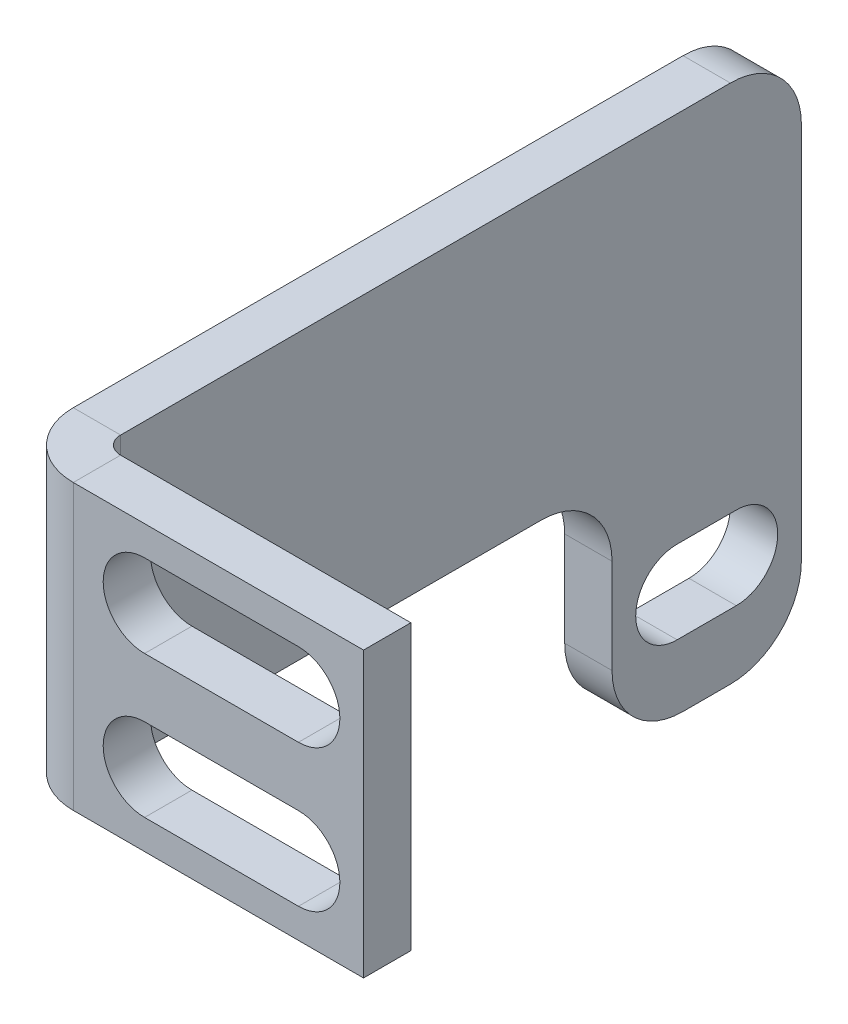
ISO-10303-21;
HEADER;
FILE_DESCRIPTION(('STEP AP214'),'2;1');
FILE_NAME('part.step','',(''),(''),'','','');
FILE_SCHEMA(('AUTOMOTIVE_DESIGN { 1 0 10303 214 1 1 1 1 }'));
ENDSEC;
DATA;
#1=APPLICATION_CONTEXT('core data for automotive mechanical design processes');
#2=APPLICATION_PROTOCOL_DEFINITION('international standard','automotive_design',2000,#1);
#3=PRODUCT_CONTEXT('',#1,'mechanical');
#4=PRODUCT('Part','Part','',(#3));
#5=PRODUCT_RELATED_PRODUCT_CATEGORY('part','',(#4));
#6=PRODUCT_DEFINITION_FORMATION('','',#4);
#7=PRODUCT_DEFINITION_CONTEXT('part definition',#1,'design');
#8=PRODUCT_DEFINITION('design','',#6,#7);
#9=PRODUCT_DEFINITION_SHAPE('','',#8);
#10=(LENGTH_UNIT() NAMED_UNIT(*) SI_UNIT(.MILLI.,.METRE.));
#11=(NAMED_UNIT(*) PLANE_ANGLE_UNIT() SI_UNIT($,.RADIAN.));
#12=(NAMED_UNIT(*) SI_UNIT($,.STERADIAN.) SOLID_ANGLE_UNIT());
#13=UNCERTAINTY_MEASURE_WITH_UNIT(LENGTH_MEASURE(1.E-05),#10,'distance_accuracy_value','');
#14=(GEOMETRIC_REPRESENTATION_CONTEXT(3) GLOBAL_UNCERTAINTY_ASSIGNED_CONTEXT((#13)) GLOBAL_UNIT_ASSIGNED_CONTEXT((#10,
#11,#12)) REPRESENTATION_CONTEXT('',''));
#15=CARTESIAN_POINT('',(0.,0.,0.));
#16=DIRECTION('',(0.,0.,1.));
#17=DIRECTION('',(1.,0.,0.));
#18=AXIS2_PLACEMENT_3D('',#15,#16,#17);
#19=CARTESIAN_POINT('',(0.,0.,0.));
#20=DIRECTION('',(0.,0.,-1.));
#21=DIRECTION('',(-1.,0.,0.));
#22=AXIS2_PLACEMENT_3D('',#19,#20,#21);
#23=PLANE('',#22);
#24=CARTESIAN_POINT('',(109.249999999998,-9.,0.));
#25=DIRECTION('',(0.,0.,-1.));
#26=DIRECTION('',(-1.,0.,0.));
#27=AXIS2_PLACEMENT_3D('',#24,#25,#26);
#28=CIRCLE('',#27,1.75);
#29=CARTESIAN_POINT('',(109.249999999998,-7.25,0.));
#30=VERTEX_POINT('',#29);
#31=CARTESIAN_POINT('',(109.249999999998,-10.75,0.));
#32=VERTEX_POINT('',#31);
#33=EDGE_CURVE('E217',#30,#32,#28,.T.);
#34=ORIENTED_EDGE('',*,*,#33,.T.);
#35=DIRECTION('',(1.,0.,0.));
#36=VECTOR('',#35,1.);
#37=CARTESIAN_POINT('',(102.749999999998,-10.75,0.));
#38=LINE('',#37,#36);
#39=CARTESIAN_POINT('',(102.749999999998,-10.75,0.));
#40=VERTEX_POINT('',#39);
#41=EDGE_CURVE('E198',#40,#32,#38,.T.);
#42=ORIENTED_EDGE('',*,*,#41,.F.);
#43=CARTESIAN_POINT('',(102.749999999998,-9.,0.));
#44=DIRECTION('',(0.,0.,-1.));
#45=DIRECTION('',(-1.,0.,0.));
#46=AXIS2_PLACEMENT_3D('',#43,#44,#45);
#47=CIRCLE('',#46,1.75);
#48=CARTESIAN_POINT('',(102.749999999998,-7.25,0.));
#49=VERTEX_POINT('',#48);
#50=EDGE_CURVE('E202',#40,#49,#47,.T.);
#51=ORIENTED_EDGE('',*,*,#50,.T.);
#52=DIRECTION('',(1.,0.,0.));
#53=VECTOR('',#52,1.);
#54=CARTESIAN_POINT('',(102.749999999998,-7.25,0.));
#55=LINE('',#54,#53);
#56=EDGE_CURVE('E800',#49,#30,#55,.T.);
#57=ORIENTED_EDGE('',*,*,#56,.T.);
#58=EDGE_LOOP('',(#34,#42,#51,#57));
#59=FACE_BOUND('',#58,.T.);
#60=DIRECTION('',(0.,1.,0.));
#61=VECTOR('',#60,1.);
#62=CARTESIAN_POINT('',(99.736599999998,0.,0.));
#63=LINE('',#62,#61);
#64=CARTESIAN_POINT('',(99.736599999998,0.,0.));
#65=VERTEX_POINT('',#64);
#66=CARTESIAN_POINT('',(99.736599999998,-12.,0.));
#67=VERTEX_POINT('',#66);
#68=EDGE_CURVE('E312',#65,#67,#63,.F.);
#69=ORIENTED_EDGE('',*,*,#68,.T.);
#70=DIRECTION('',(1.,0.,0.));
#71=VECTOR('',#70,1.);
#72=CARTESIAN_POINT('',(111.999999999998,-12.,0.));
#73=LINE('',#72,#71);
#74=CARTESIAN_POINT('',(111.999999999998,-12.,0.));
#75=VERTEX_POINT('',#74);
#76=EDGE_CURVE('E338',#67,#75,#73,.T.);
#77=ORIENTED_EDGE('',*,*,#76,.T.);
#78=DIRECTION('',(0.,1.,0.));
#79=VECTOR('',#78,1.);
#80=CARTESIAN_POINT('',(111.999999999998,0.,0.));
#81=LINE('',#80,#79);
#82=CARTESIAN_POINT('',(111.999999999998,0.,0.));
#83=VERTEX_POINT('',#82);
#84=EDGE_CURVE('E332',#75,#83,#81,.T.);
#85=ORIENTED_EDGE('',*,*,#84,.T.);
#86=DIRECTION('',(-1.,0.,0.));
#87=VECTOR('',#86,1.);
#88=CARTESIAN_POINT('',(111.999999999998,0.,0.));
#89=LINE('',#88,#87);
#90=EDGE_CURVE('E346',#83,#65,#89,.T.);
#91=ORIENTED_EDGE('',*,*,#90,.T.);
#92=EDGE_LOOP('',(#69,#77,#85,#91));
#93=FACE_BOUND('',#92,.T.);
#94=DIRECTION('',(1.,0.,0.));
#95=VECTOR('',#94,1.);
#96=CARTESIAN_POINT('',(102.749999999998,-4.75000000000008,0.));
#97=LINE('',#96,#95);
#98=CARTESIAN_POINT('',(102.749999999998,-4.75000000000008,0.));
#99=VERTEX_POINT('',#98);
#100=CARTESIAN_POINT('',(109.249999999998,-4.75000000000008,0.));
#101=VERTEX_POINT('',#100);
#102=EDGE_CURVE('E227',#99,#101,#97,.T.);
#103=ORIENTED_EDGE('',*,*,#102,.F.);
#104=CARTESIAN_POINT('',(102.749999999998,-3.00000000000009,0.));
#105=DIRECTION('',(0.,0.,-1.));
#106=DIRECTION('',(-1.,0.,0.));
#107=AXIS2_PLACEMENT_3D('',#104,#105,#106);
#108=CIRCLE('',#107,1.75);
#109=CARTESIAN_POINT('',(102.749999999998,-1.25000000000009,0.));
#110=VERTEX_POINT('',#109);
#111=EDGE_CURVE('E234',#99,#110,#108,.T.);
#112=ORIENTED_EDGE('',*,*,#111,.T.);
#113=DIRECTION('',(1.,0.,0.));
#114=VECTOR('',#113,1.);
#115=CARTESIAN_POINT('',(102.749999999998,-1.25000000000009,0.));
#116=LINE('',#115,#114);
#117=CARTESIAN_POINT('',(109.249999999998,-1.25000000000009,0.));
#118=VERTEX_POINT('',#117);
#119=EDGE_CURVE('E224',#110,#118,#116,.T.);
#120=ORIENTED_EDGE('',*,*,#119,.T.);
#121=CARTESIAN_POINT('',(109.249999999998,-3.00000000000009,0.));
#122=DIRECTION('',(0.,0.,-1.));
#123=DIRECTION('',(-1.,0.,0.));
#124=AXIS2_PLACEMENT_3D('',#121,#122,#123);
#125=CIRCLE('',#124,1.75);
#126=EDGE_CURVE('E245',#118,#101,#125,.T.);
#127=ORIENTED_EDGE('',*,*,#126,.T.);
#128=EDGE_LOOP('',(#103,#112,#120,#127));
#129=FACE_BOUND('',#128,.T.);
#130=ADVANCED_FACE('F16',(#59,#93,#129),#23,.F.);
#131=CARTESIAN_POINT('',(96.999999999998,-12.,-2.));
#132=DIRECTION('',(0.,1.,0.));
#133=DIRECTION('',(0.,0.,1.));
#134=AXIS2_PLACEMENT_3D('',#131,#132,#133);
#135=PLANE('',#134);
#136=DIRECTION('',(0.,0.,1.));
#137=VECTOR('',#136,1.);
#138=CARTESIAN_POINT('',(96.999999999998,-12.,-3.12441373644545E-13));
#139=LINE('',#138,#137);
#140=CARTESIAN_POINT('',(96.9999999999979,-12.,-20.5));
#141=VERTEX_POINT('',#140);
#142=CARTESIAN_POINT('',(96.999999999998,-12.,-2.7366));
#143=VERTEX_POINT('',#142);
#144=EDGE_CURVE('E285',#141,#143,#139,.T.);
#145=ORIENTED_EDGE('',*,*,#144,.F.);
#146=DIRECTION('',(-1.,0.,0.));
#147=VECTOR('',#146,1.);
#148=CARTESIAN_POINT('',(98.9999999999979,-12.,-20.5));
#149=LINE('',#148,#147);
#150=CARTESIAN_POINT('',(98.999999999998,-12.,-20.5));
#151=VERTEX_POINT('',#150);
#152=EDGE_CURVE('E394',#141,#151,#149,.F.);
#153=ORIENTED_EDGE('',*,*,#152,.T.);
#154=DIRECTION('',(0.,0.,-1.));
#155=VECTOR('',#154,1.);
#156=CARTESIAN_POINT('',(98.999999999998,-12.,-2.));
#157=LINE('',#156,#155);
#158=CARTESIAN_POINT('',(98.999999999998,-12.,-2.7366));
#159=VERTEX_POINT('',#158);
#160=EDGE_CURVE('E294',#151,#159,#157,.F.);
#161=ORIENTED_EDGE('',*,*,#160,.T.);
#162=DIRECTION('',(1.,0.,0.));
#163=VECTOR('',#162,1.);
#164=CARTESIAN_POINT('',(96.999999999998,-12.,-2.7366));
#165=LINE('',#164,#163);
#166=EDGE_CURVE('E284',#159,#143,#165,.F.);
#167=ORIENTED_EDGE('',*,*,#166,.T.);
#168=EDGE_LOOP('',(#145,#153,#161,#167));
#169=FACE_BOUND('',#168,.T.);
#170=ADVANCED_FACE('F404',(#169),#135,.F.);
#171=CARTESIAN_POINT('',(111.999999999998,0.,-2.));
#172=DIRECTION('',(0.,1.,0.));
#173=DIRECTION('',(-1.,0.,0.));
#174=AXIS2_PLACEMENT_3D('',#171,#172,#173);
#175=PLANE('',#174);
#176=DIRECTION('',(-1.,0.,0.));
#177=VECTOR('',#176,1.);
#178=CARTESIAN_POINT('',(111.999999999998,0.,-2.));
#179=LINE('',#178,#177);
#180=CARTESIAN_POINT('',(111.999999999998,0.,-2.));
#181=VERTEX_POINT('',#180);
#182=CARTESIAN_POINT('',(99.736599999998,0.,-2.));
#183=VERTEX_POINT('',#182);
#184=EDGE_CURVE('E337',#181,#183,#179,.T.);
#185=ORIENTED_EDGE('',*,*,#184,.T.);
#186=DIRECTION('',(0.,0.,1.));
#187=VECTOR('',#186,1.);
#188=CARTESIAN_POINT('',(99.736599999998,0.,-2.));
#189=LINE('',#188,#187);
#190=EDGE_CURVE('E318',#183,#65,#189,.T.);
#191=ORIENTED_EDGE('',*,*,#190,.T.);
#192=ORIENTED_EDGE('',*,*,#90,.F.);
#193=DIRECTION('',(0.,0.,1.));
#194=VECTOR('',#193,1.);
#195=CARTESIAN_POINT('',(111.999999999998,0.,-2.));
#196=LINE('',#195,#194);
#197=EDGE_CURVE('E343',#181,#83,#196,.T.);
#198=ORIENTED_EDGE('',*,*,#197,.F.);
#199=EDGE_LOOP('',(#185,#191,#192,#198));
#200=FACE_BOUND('',#199,.T.);
#201=ADVANCED_FACE('F481',(#200),#175,.T.);
#202=CARTESIAN_POINT('',(0.,0.,-2.));
#203=DIRECTION('',(0.,0.,-1.));
#204=DIRECTION('',(-1.,0.,0.));
#205=AXIS2_PLACEMENT_3D('',#202,#203,#204);
#206=PLANE('',#205);
#207=CARTESIAN_POINT('',(109.249999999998,-9.,-2.));
#208=DIRECTION('',(0.,0.,-1.));
#209=DIRECTION('',(-1.,0.,0.));
#210=AXIS2_PLACEMENT_3D('',#207,#208,#209);
#211=CIRCLE('',#210,1.75);
#212=CARTESIAN_POINT('',(109.249999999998,-7.25,-2.));
#213=VERTEX_POINT('',#212);
#214=CARTESIAN_POINT('',(109.249999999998,-10.75,-2.));
#215=VERTEX_POINT('',#214);
#216=EDGE_CURVE('E204',#213,#215,#211,.T.);
#217=ORIENTED_EDGE('',*,*,#216,.F.);
#218=DIRECTION('',(1.,0.,0.));
#219=VECTOR('',#218,1.);
#220=CARTESIAN_POINT('',(102.749999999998,-7.25,-2.));
#221=LINE('',#220,#219);
#222=CARTESIAN_POINT('',(102.749999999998,-7.25,-2.));
#223=VERTEX_POINT('',#222);
#224=EDGE_CURVE('E210',#223,#213,#221,.T.);
#225=ORIENTED_EDGE('',*,*,#224,.F.);
#226=CARTESIAN_POINT('',(102.749999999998,-9.,-2.));
#227=DIRECTION('',(0.,0.,-1.));
#228=DIRECTION('',(-1.,0.,0.));
#229=AXIS2_PLACEMENT_3D('',#226,#227,#228);
#230=CIRCLE('',#229,1.75);
#231=CARTESIAN_POINT('',(102.749999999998,-10.75,-2.));
#232=VERTEX_POINT('',#231);
#233=EDGE_CURVE('E39',#232,#223,#230,.T.);
#234=ORIENTED_EDGE('',*,*,#233,.F.);
#235=DIRECTION('',(1.,0.,0.));
#236=VECTOR('',#235,1.);
#237=CARTESIAN_POINT('',(102.749999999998,-10.75,-2.));
#238=LINE('',#237,#236);
#239=EDGE_CURVE('E189',#232,#215,#238,.T.);
#240=ORIENTED_EDGE('',*,*,#239,.T.);
#241=EDGE_LOOP('',(#217,#225,#234,#240));
#242=FACE_BOUND('',#241,.T.);
#243=DIRECTION('',(1.,0.,0.));
#244=VECTOR('',#243,1.);
#245=CARTESIAN_POINT('',(102.749999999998,-4.75000000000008,-2.));
#246=LINE('',#245,#244);
#247=CARTESIAN_POINT('',(102.749999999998,-4.75000000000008,-2.));
#248=VERTEX_POINT('',#247);
#249=CARTESIAN_POINT('',(109.249999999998,-4.75000000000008,-2.));
#250=VERTEX_POINT('',#249);
#251=EDGE_CURVE('E229',#248,#250,#246,.T.);
#252=ORIENTED_EDGE('',*,*,#251,.T.);
#253=CARTESIAN_POINT('',(109.249999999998,-3.00000000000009,-2.));
#254=DIRECTION('',(0.,0.,-1.));
#255=DIRECTION('',(-1.,0.,0.));
#256=AXIS2_PLACEMENT_3D('',#253,#254,#255);
#257=CIRCLE('',#256,1.75);
#258=CARTESIAN_POINT('',(109.249999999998,-1.25000000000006,-2.));
#259=VERTEX_POINT('',#258);
#260=EDGE_CURVE('E242',#259,#250,#257,.T.);
#261=ORIENTED_EDGE('',*,*,#260,.F.);
#262=DIRECTION('',(1.,0.,0.));
#263=VECTOR('',#262,1.);
#264=CARTESIAN_POINT('',(102.749999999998,-1.25000000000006,-2.));
#265=LINE('',#264,#263);
#266=CARTESIAN_POINT('',(102.749999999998,-1.25000000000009,-2.));
#267=VERTEX_POINT('',#266);
#268=EDGE_CURVE('E222',#267,#259,#265,.T.);
#269=ORIENTED_EDGE('',*,*,#268,.F.);
#270=CARTESIAN_POINT('',(102.749999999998,-3.00000000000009,-2.));
#271=DIRECTION('',(0.,0.,-1.));
#272=DIRECTION('',(-1.,0.,0.));
#273=AXIS2_PLACEMENT_3D('',#270,#271,#272);
#274=CIRCLE('',#273,1.75);
#275=EDGE_CURVE('E232',#248,#267,#274,.T.);
#276=ORIENTED_EDGE('',*,*,#275,.F.);
#277=EDGE_LOOP('',(#252,#261,#269,#276));
#278=FACE_BOUND('',#277,.T.);
#279=DIRECTION('',(1.,0.,0.));
#280=VECTOR('',#279,1.);
#281=CARTESIAN_POINT('',(111.999999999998,-12.,-2.));
#282=LINE('',#281,#280);
#283=CARTESIAN_POINT('',(99.736599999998,-12.,-2.));
#284=VERTEX_POINT('',#283);
#285=CARTESIAN_POINT('',(111.999999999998,-12.,-2.));
#286=VERTEX_POINT('',#285);
#287=EDGE_CURVE('E341',#284,#286,#282,.T.);
#288=ORIENTED_EDGE('',*,*,#287,.F.);
#289=DIRECTION('',(0.,1.,0.));
#290=VECTOR('',#289,1.);
#291=CARTESIAN_POINT('',(99.736599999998,0.,-2.));
#292=LINE('',#291,#290);
#293=EDGE_CURVE('E324',#183,#284,#292,.F.);
#294=ORIENTED_EDGE('',*,*,#293,.F.);
#295=ORIENTED_EDGE('',*,*,#184,.F.);
#296=DIRECTION('',(0.,1.,0.));
#297=VECTOR('',#296,1.);
#298=CARTESIAN_POINT('',(111.999999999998,0.,-2.));
#299=LINE('',#298,#297);
#300=EDGE_CURVE('E334',#286,#181,#299,.T.);
#301=ORIENTED_EDGE('',*,*,#300,.F.);
#302=EDGE_LOOP('',(#288,#294,#295,#301));
#303=FACE_BOUND('',#302,.T.);
#304=ADVANCED_FACE('F208',(#242,#278,#303),#206,.T.);
#305=CARTESIAN_POINT('',(111.999999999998,0.,-2.));
#306=DIRECTION('',(1.,0.,0.));
#307=DIRECTION('',(0.,0.,-1.));
#308=AXIS2_PLACEMENT_3D('',#305,#306,#307);
#309=PLANE('',#308);
#310=ORIENTED_EDGE('',*,*,#84,.F.);
#311=DIRECTION('',(0.,0.,1.));
#312=VECTOR('',#311,1.);
#313=CARTESIAN_POINT('',(111.999999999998,-12.,-2.));
#314=LINE('',#313,#312);
#315=EDGE_CURVE('E350',#286,#75,#314,.T.);
#316=ORIENTED_EDGE('',*,*,#315,.F.);
#317=ORIENTED_EDGE('',*,*,#300,.T.);
#318=ORIENTED_EDGE('',*,*,#197,.T.);
#319=EDGE_LOOP('',(#310,#316,#317,#318));
#320=FACE_BOUND('',#319,.T.);
#321=ADVANCED_FACE('F489',(#320),#309,.T.);
#322=CARTESIAN_POINT('',(111.999999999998,-12.,-2.));
#323=DIRECTION('',(0.,-1.,0.));
#324=DIRECTION('',(1.,0.,0.));
#325=AXIS2_PLACEMENT_3D('',#322,#323,#324);
#326=PLANE('',#325);
#327=DIRECTION('',(0.,0.,1.));
#328=VECTOR('',#327,1.);
#329=CARTESIAN_POINT('',(99.736599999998,-12.,-2.));
#330=LINE('',#329,#328);
#331=EDGE_CURVE('E329',#284,#67,#330,.T.);
#332=ORIENTED_EDGE('',*,*,#331,.F.);
#333=ORIENTED_EDGE('',*,*,#287,.T.);
#334=ORIENTED_EDGE('',*,*,#315,.T.);
#335=ORIENTED_EDGE('',*,*,#76,.F.);
#336=EDGE_LOOP('',(#332,#333,#334,#335));
#337=FACE_BOUND('',#336,.T.);
#338=ADVANCED_FACE('F456',(#337),#326,.T.);
#339=CARTESIAN_POINT('',(99.736599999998,-12.,-2.7366));
#340=DIRECTION('',(0.,-1.,0.));
#341=DIRECTION('',(0.,0.,-1.));
#342=AXIS2_PLACEMENT_3D('',#339,#340,#341);
#343=PLANE('',#342);
#344=ORIENTED_EDGE('',*,*,#166,.F.);
#345=CARTESIAN_POINT('',(99.736599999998,-12.,-2.7366));
#346=DIRECTION('',(0.,1.,0.));
#347=DIRECTION('',(0.,0.,1.));
#348=AXIS2_PLACEMENT_3D('',#345,#346,#347);
#349=CIRCLE('',#348,0.7366);
#350=EDGE_CURVE('E321',#284,#159,#349,.F.);
#351=ORIENTED_EDGE('',*,*,#350,.F.);
#352=ORIENTED_EDGE('',*,*,#331,.T.);
#353=CARTESIAN_POINT('',(99.736599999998,-12.,-2.7366));
#354=DIRECTION('',(0.,1.,0.));
#355=DIRECTION('',(0.,0.,1.));
#356=AXIS2_PLACEMENT_3D('',#353,#354,#355);
#357=CIRCLE('',#356,2.7366);
#358=EDGE_CURVE('E314',#67,#143,#357,.F.);
#359=ORIENTED_EDGE('',*,*,#358,.T.);
#360=EDGE_LOOP('',(#344,#351,#352,#359));
#361=FACE_BOUND('',#360,.T.);
#362=ADVANCED_FACE('F451',(#361),#343,.T.);
#363=CARTESIAN_POINT('',(99.736599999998,0.,-2.7366));
#364=DIRECTION('',(0.,-1.,0.));
#365=DIRECTION('',(0.,0.,-1.));
#366=AXIS2_PLACEMENT_3D('',#363,#364,#365);
#367=PLANE('',#366);
#368=CARTESIAN_POINT('',(99.736599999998,0.,-2.7366));
#369=DIRECTION('',(0.,1.,0.));
#370=DIRECTION('',(0.,0.,1.));
#371=AXIS2_PLACEMENT_3D('',#368,#369,#370);
#372=CIRCLE('',#371,0.7366);
#373=CARTESIAN_POINT('',(98.999999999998,0.,-2.7366));
#374=VERTEX_POINT('',#373);
#375=EDGE_CURVE('E287',#374,#183,#372,.T.);
#376=ORIENTED_EDGE('',*,*,#375,.F.);
#377=DIRECTION('',(1.,0.,0.));
#378=VECTOR('',#377,1.);
#379=CARTESIAN_POINT('',(98.999999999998,0.,-2.7366));
#380=LINE('',#379,#378);
#381=CARTESIAN_POINT('',(96.999999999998,0.,-2.7366));
#382=VERTEX_POINT('',#381);
#383=EDGE_CURVE('E305',#374,#382,#380,.F.);
#384=ORIENTED_EDGE('',*,*,#383,.T.);
#385=CARTESIAN_POINT('',(99.736599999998,0.,-2.7366));
#386=DIRECTION('',(0.,1.,0.));
#387=DIRECTION('',(0.,0.,1.));
#388=AXIS2_PLACEMENT_3D('',#385,#386,#387);
#389=CIRCLE('',#388,2.7366);
#390=EDGE_CURVE('E315',#382,#65,#389,.T.);
#391=ORIENTED_EDGE('',*,*,#390,.T.);
#392=ORIENTED_EDGE('',*,*,#190,.F.);
#393=EDGE_LOOP('',(#376,#384,#391,#392));
#394=FACE_BOUND('',#393,.T.);
#395=ADVANCED_FACE('F444',(#394),#367,.F.);
#396=CARTESIAN_POINT('',(99.736599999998,0.,-2.7366));
#397=DIRECTION('',(0.,1.,0.));
#398=DIRECTION('',(-1.,0.,0.));
#399=AXIS2_PLACEMENT_3D('',#396,#397,#398);
#400=CYLINDRICAL_SURFACE('',#399,2.7366);
#401=ORIENTED_EDGE('',*,*,#68,.F.);
#402=ORIENTED_EDGE('',*,*,#390,.F.);
#403=DIRECTION('',(0.,1.,0.));
#404=VECTOR('',#403,1.);
#405=CARTESIAN_POINT('',(96.999999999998,-12.,-2.7366));
#406=LINE('',#405,#404);
#407=EDGE_CURVE('E302',#382,#143,#406,.F.);
#408=ORIENTED_EDGE('',*,*,#407,.T.);
#409=ORIENTED_EDGE('',*,*,#358,.F.);
#410=EDGE_LOOP('',(#401,#402,#408,#409));
#411=FACE_BOUND('',#410,.T.);
#412=ADVANCED_FACE('F449',(#411),#400,.T.);
#413=CARTESIAN_POINT('',(99.736599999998,0.,-2.7366));
#414=DIRECTION('',(0.,1.,0.));
#415=DIRECTION('',(-1.,0.,0.));
#416=AXIS2_PLACEMENT_3D('',#413,#414,#415);
#417=CYLINDRICAL_SURFACE('',#416,0.7366);
#418=ORIENTED_EDGE('',*,*,#293,.T.);
#419=ORIENTED_EDGE('',*,*,#350,.T.);
#420=DIRECTION('',(0.,1.,0.));
#421=VECTOR('',#420,1.);
#422=CARTESIAN_POINT('',(98.999999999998,-12.,-2.7366));
#423=LINE('',#422,#421);
#424=EDGE_CURVE('E308',#159,#374,#423,.T.);
#425=ORIENTED_EDGE('',*,*,#424,.T.);
#426=ORIENTED_EDGE('',*,*,#375,.T.);
#427=EDGE_LOOP('',(#418,#419,#425,#426));
#428=FACE_BOUND('',#427,.T.);
#429=ADVANCED_FACE('F462',(#428),#417,.F.);
#430=CARTESIAN_POINT('',(96.9999999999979,0.,-31.5));
#431=DIRECTION('',(0.,-1.,0.));
#432=DIRECTION('',(0.,0.,-1.));
#433=AXIS2_PLACEMENT_3D('',#430,#431,#432);
#434=PLANE('',#433);
#435=DIRECTION('',(0.,0.,1.));
#436=VECTOR('',#435,1.);
#437=CARTESIAN_POINT('',(98.9999999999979,0.,-31.5));
#438=LINE('',#437,#436);
#439=CARTESIAN_POINT('',(98.9999999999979,0.,-28.5));
#440=VERTEX_POINT('',#439);
#441=EDGE_CURVE('E299',#374,#440,#438,.F.);
#442=ORIENTED_EDGE('',*,*,#441,.T.);
#443=DIRECTION('',(1.,0.,0.));
#444=VECTOR('',#443,1.);
#445=CARTESIAN_POINT('',(96.9999999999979,0.,-28.5));
#446=LINE('',#445,#444);
#447=CARTESIAN_POINT('',(96.9999999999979,0.,-28.5));
#448=VERTEX_POINT('',#447);
#449=EDGE_CURVE('E375',#440,#448,#446,.F.);
#450=ORIENTED_EDGE('',*,*,#449,.T.);
#451=DIRECTION('',(0.,0.,-1.));
#452=VECTOR('',#451,1.);
#453=CARTESIAN_POINT('',(96.999999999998,0.,-3.12441373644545E-13));
#454=LINE('',#453,#452);
#455=EDGE_CURVE('E291',#382,#448,#454,.T.);
#456=ORIENTED_EDGE('',*,*,#455,.F.);
#457=ORIENTED_EDGE('',*,*,#383,.F.);
#458=EDGE_LOOP('',(#442,#450,#456,#457));
#459=FACE_BOUND('',#458,.T.);
#460=ADVANCED_FACE('F440',(#459),#434,.F.);
#461=CARTESIAN_POINT('',(96.999999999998,0.,-3.12441373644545E-13));
#462=DIRECTION('',(1.,0.,0.));
#463=DIRECTION('',(0.,0.,-1.));
#464=AXIS2_PLACEMENT_3D('',#461,#462,#463);
#465=PLANE('',#464);
#466=CARTESIAN_POINT('',(96.9999999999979,-17.5,-28.75));
#467=DIRECTION('',(-1.,0.,0.));
#468=DIRECTION('',(0.,0.,1.));
#469=AXIS2_PLACEMENT_3D('',#466,#467,#468);
#470=CIRCLE('',#469,1.75);
#471=CARTESIAN_POINT('',(96.9999999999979,-15.75,-28.75));
#472=VERTEX_POINT('',#471);
#473=CARTESIAN_POINT('',(96.9999999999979,-19.25,-28.75));
#474=VERTEX_POINT('',#473);
#475=EDGE_CURVE('E260',#472,#474,#470,.T.);
#476=ORIENTED_EDGE('',*,*,#475,.F.);
#477=DIRECTION('',(0.,0.,1.));
#478=VECTOR('',#477,1.);
#479=CARTESIAN_POINT('',(96.9999999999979,-15.75,-28.75));
#480=LINE('',#479,#478);
#481=CARTESIAN_POINT('',(96.9999999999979,-15.75,-26.25));
#482=VERTEX_POINT('',#481);
#483=EDGE_CURVE('E254',#472,#482,#480,.T.);
#484=ORIENTED_EDGE('',*,*,#483,.T.);
#485=CARTESIAN_POINT('',(96.9999999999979,-17.5,-26.25));
#486=DIRECTION('',(-1.,0.,0.));
#487=DIRECTION('',(0.,0.,1.));
#488=AXIS2_PLACEMENT_3D('',#485,#486,#487);
#489=CIRCLE('',#488,1.75);
#490=CARTESIAN_POINT('',(96.9999999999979,-19.25,-26.25));
#491=VERTEX_POINT('',#490);
#492=EDGE_CURVE('E268',#491,#482,#489,.T.);
#493=ORIENTED_EDGE('',*,*,#492,.F.);
#494=DIRECTION('',(0.,0.,1.));
#495=VECTOR('',#494,1.);
#496=CARTESIAN_POINT('',(96.9999999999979,-19.25,-28.75));
#497=LINE('',#496,#495);
#498=EDGE_CURVE('E252',#474,#491,#497,.T.);
#499=ORIENTED_EDGE('',*,*,#498,.F.);
#500=EDGE_LOOP('',(#476,#484,#493,#499));
#501=FACE_BOUND('',#500,.T.);
#502=ORIENTED_EDGE('',*,*,#455,.T.);
#503=CARTESIAN_POINT('',(96.9999999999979,-3.,-28.5));
#504=DIRECTION('',(1.,0.,0.));
#505=DIRECTION('',(0.,0.,-1.));
#506=AXIS2_PLACEMENT_3D('',#503,#504,#505);
#507=CIRCLE('',#506,3.);
#508=CARTESIAN_POINT('',(96.9999999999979,-3.,-31.5));
#509=VERTEX_POINT('',#508);
#510=EDGE_CURVE('E381',#448,#509,#507,.F.);
#511=ORIENTED_EDGE('',*,*,#510,.T.);
#512=DIRECTION('',(0.,-1.,0.));
#513=VECTOR('',#512,1.);
#514=CARTESIAN_POINT('',(96.9999999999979,0.,-31.5));
#515=LINE('',#514,#513);
#516=CARTESIAN_POINT('',(96.9999999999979,-19.,-31.5));
#517=VERTEX_POINT('',#516);
#518=EDGE_CURVE('E288',#509,#517,#515,.T.);
#519=ORIENTED_EDGE('',*,*,#518,.T.);
#520=CARTESIAN_POINT('',(96.9999999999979,-19.,-28.5));
#521=DIRECTION('',(1.,0.,0.));
#522=DIRECTION('',(0.,0.,-1.));
#523=AXIS2_PLACEMENT_3D('',#520,#521,#522);
#524=CIRCLE('',#523,3.);
#525=CARTESIAN_POINT('',(96.9999999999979,-22.,-28.5));
#526=VERTEX_POINT('',#525);
#527=EDGE_CURVE('E379',#517,#526,#524,.F.);
#528=ORIENTED_EDGE('',*,*,#527,.T.);
#529=DIRECTION('',(0.,0.,-1.));
#530=VECTOR('',#529,1.);
#531=CARTESIAN_POINT('',(96.9999999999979,-22.,-31.5));
#532=LINE('',#531,#530);
#533=CARTESIAN_POINT('',(96.9999999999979,-22.,-26.5));
#534=VERTEX_POINT('',#533);
#535=EDGE_CURVE('E272',#534,#526,#532,.T.);
#536=ORIENTED_EDGE('',*,*,#535,.F.);
#537=CARTESIAN_POINT('',(96.9999999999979,-19.,-26.5));
#538=DIRECTION('',(1.,0.,0.));
#539=DIRECTION('',(0.,0.,-1.));
#540=AXIS2_PLACEMENT_3D('',#537,#538,#539);
#541=CIRCLE('',#540,3.);
#542=CARTESIAN_POINT('',(96.9999999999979,-19.,-23.5));
#543=VERTEX_POINT('',#542);
#544=EDGE_CURVE('E377',#534,#543,#541,.F.);
#545=ORIENTED_EDGE('',*,*,#544,.T.);
#546=DIRECTION('',(0.,1.,0.));
#547=VECTOR('',#546,1.);
#548=CARTESIAN_POINT('',(96.9999999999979,-22.,-23.5));
#549=LINE('',#548,#547);
#550=CARTESIAN_POINT('',(96.9999999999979,-15.,-23.5));
#551=VERTEX_POINT('',#550);
#552=EDGE_CURVE('E278',#543,#551,#549,.T.);
#553=ORIENTED_EDGE('',*,*,#552,.T.);
#554=CARTESIAN_POINT('',(96.9999999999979,-15.,-20.5));
#555=DIRECTION('',(1.,0.,0.));
#556=DIRECTION('',(0.,0.,-1.));
#557=AXIS2_PLACEMENT_3D('',#554,#555,#556);
#558=CIRCLE('',#557,3.);
#559=EDGE_CURVE('E24',#551,#141,#558,.T.);
#560=ORIENTED_EDGE('',*,*,#559,.T.);
#561=ORIENTED_EDGE('',*,*,#144,.T.);
#562=ORIENTED_EDGE('',*,*,#407,.F.);
#563=EDGE_LOOP('',(#502,#511,#519,#528,#536,#545,#553,#560,#561,#562));
#564=FACE_BOUND('',#563,.T.);
#565=ADVANCED_FACE('F397',(#501,#564),#465,.F.);
#566=CARTESIAN_POINT('',(98.999999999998,0.,-3.19424336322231E-13));
#567=DIRECTION('',(1.,0.,0.));
#568=DIRECTION('',(0.,0.,-1.));
#569=AXIS2_PLACEMENT_3D('',#566,#567,#568);
#570=PLANE('',#569);
#571=CARTESIAN_POINT('',(98.9999999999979,-17.5,-26.25));
#572=DIRECTION('',(1.,0.,0.));
#573=DIRECTION('',(0.,0.,-1.));
#574=AXIS2_PLACEMENT_3D('',#571,#572,#573);
#575=CIRCLE('',#574,1.75);
#576=CARTESIAN_POINT('',(98.9999999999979,-15.75,-26.25));
#577=VERTEX_POINT('',#576);
#578=CARTESIAN_POINT('',(98.9999999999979,-19.25,-26.25));
#579=VERTEX_POINT('',#578);
#580=EDGE_CURVE('E361',#577,#579,#575,.T.);
#581=ORIENTED_EDGE('',*,*,#580,.F.);
#582=DIRECTION('',(0.,0.,-1.));
#583=VECTOR('',#582,1.);
#584=CARTESIAN_POINT('',(98.999999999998,-15.75,-3.19424336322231E-13));
#585=LINE('',#584,#583);
#586=CARTESIAN_POINT('',(98.9999999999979,-15.75,-28.75));
#587=VERTEX_POINT('',#586);
#588=EDGE_CURVE('E358',#577,#587,#585,.T.);
#589=ORIENTED_EDGE('',*,*,#588,.T.);
#590=CARTESIAN_POINT('',(98.9999999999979,-17.5,-28.75));
#591=DIRECTION('',(1.,0.,0.));
#592=DIRECTION('',(0.,0.,-1.));
#593=AXIS2_PLACEMENT_3D('',#590,#591,#592);
#594=CIRCLE('',#593,1.75);
#595=CARTESIAN_POINT('',(98.9999999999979,-19.25,-28.75));
#596=VERTEX_POINT('',#595);
#597=EDGE_CURVE('E356',#596,#587,#594,.T.);
#598=ORIENTED_EDGE('',*,*,#597,.F.);
#599=DIRECTION('',(0.,0.,-1.));
#600=VECTOR('',#599,1.);
#601=CARTESIAN_POINT('',(98.999999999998,-19.25,-3.19424336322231E-13));
#602=LINE('',#601,#600);
#603=EDGE_CURVE('E353',#579,#596,#602,.T.);
#604=ORIENTED_EDGE('',*,*,#603,.F.);
#605=EDGE_LOOP('',(#581,#589,#598,#604));
#606=FACE_BOUND('',#605,.T.);
#607=DIRECTION('',(0.,1.,0.));
#608=VECTOR('',#607,1.);
#609=CARTESIAN_POINT('',(98.9999999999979,-12.,-31.5));
#610=LINE('',#609,#608);
#611=CARTESIAN_POINT('',(98.9999999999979,-3.,-31.5));
#612=VERTEX_POINT('',#611);
#613=CARTESIAN_POINT('',(98.9999999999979,-19.,-31.5));
#614=VERTEX_POINT('',#613);
#615=EDGE_CURVE('E296',#612,#614,#610,.F.);
#616=ORIENTED_EDGE('',*,*,#615,.F.);
#617=CARTESIAN_POINT('',(98.9999999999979,-3.,-28.5));
#618=DIRECTION('',(1.,0.,0.));
#619=DIRECTION('',(0.,0.,-1.));
#620=AXIS2_PLACEMENT_3D('',#617,#618,#619);
#621=CIRCLE('',#620,3.);
#622=EDGE_CURVE('E373',#612,#440,#621,.T.);
#623=ORIENTED_EDGE('',*,*,#622,.T.);
#624=ORIENTED_EDGE('',*,*,#441,.F.);
#625=ORIENTED_EDGE('',*,*,#424,.F.);
#626=ORIENTED_EDGE('',*,*,#160,.F.);
#627=CARTESIAN_POINT('',(98.9999999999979,-15.,-20.5));
#628=DIRECTION('',(1.,0.,0.));
#629=DIRECTION('',(0.,0.,-1.));
#630=AXIS2_PLACEMENT_3D('',#627,#628,#629);
#631=CIRCLE('',#630,3.);
#632=CARTESIAN_POINT('',(98.9999999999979,-15.,-23.5));
#633=VERTEX_POINT('',#632);
#634=EDGE_CURVE('E11',#151,#633,#631,.F.);
#635=ORIENTED_EDGE('',*,*,#634,.T.);
#636=DIRECTION('',(0.,1.,0.));
#637=VECTOR('',#636,1.);
#638=CARTESIAN_POINT('',(98.9999999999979,-22.,-23.5));
#639=LINE('',#638,#637);
#640=CARTESIAN_POINT('',(98.9999999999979,-19.,-23.5));
#641=VERTEX_POINT('',#640);
#642=EDGE_CURVE('E281',#641,#633,#639,.T.);
#643=ORIENTED_EDGE('',*,*,#642,.F.);
#644=CARTESIAN_POINT('',(98.9999999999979,-19.,-26.5));
#645=DIRECTION('',(1.,0.,0.));
#646=DIRECTION('',(0.,0.,-1.));
#647=AXIS2_PLACEMENT_3D('',#644,#645,#646);
#648=CIRCLE('',#647,3.);
#649=CARTESIAN_POINT('',(98.9999999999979,-22.,-26.5));
#650=VERTEX_POINT('',#649);
#651=EDGE_CURVE('E369',#641,#650,#648,.T.);
#652=ORIENTED_EDGE('',*,*,#651,.T.);
#653=DIRECTION('',(0.,0.,1.));
#654=VECTOR('',#653,1.);
#655=CARTESIAN_POINT('',(98.9999999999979,-22.,-31.5));
#656=LINE('',#655,#654);
#657=CARTESIAN_POINT('',(98.9999999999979,-22.,-28.5));
#658=VERTEX_POINT('',#657);
#659=EDGE_CURVE('E275',#658,#650,#656,.T.);
#660=ORIENTED_EDGE('',*,*,#659,.F.);
#661=CARTESIAN_POINT('',(98.9999999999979,-19.,-28.5));
#662=DIRECTION('',(1.,0.,0.));
#663=DIRECTION('',(0.,0.,-1.));
#664=AXIS2_PLACEMENT_3D('',#661,#662,#663);
#665=CIRCLE('',#664,3.);
#666=EDGE_CURVE('E371',#658,#614,#665,.T.);
#667=ORIENTED_EDGE('',*,*,#666,.T.);
#668=EDGE_LOOP('',(#616,#623,#624,#625,#626,#635,#643,#652,#660,#667));
#669=FACE_BOUND('',#668,.T.);
#670=ADVANCED_FACE('F412',(#606,#669),#570,.T.);
#671=CARTESIAN_POINT('',(96.9999999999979,-12.,-31.5));
#672=DIRECTION('',(0.,0.,1.));
#673=DIRECTION('',(1.,0.,0.));
#674=AXIS2_PLACEMENT_3D('',#671,#672,#673);
#675=PLANE('',#674);
#676=ORIENTED_EDGE('',*,*,#518,.F.);
#677=DIRECTION('',(1.,0.,0.));
#678=VECTOR('',#677,1.);
#679=CARTESIAN_POINT('',(96.9999999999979,-3.,-31.5));
#680=LINE('',#679,#678);
#681=EDGE_CURVE('E366',#509,#612,#680,.T.);
#682=ORIENTED_EDGE('',*,*,#681,.T.);
#683=ORIENTED_EDGE('',*,*,#615,.T.);
#684=DIRECTION('',(1.,0.,0.));
#685=VECTOR('',#684,1.);
#686=CARTESIAN_POINT('',(96.9999999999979,-19.,-31.5));
#687=LINE('',#686,#685);
#688=EDGE_CURVE('E364',#614,#517,#687,.F.);
#689=ORIENTED_EDGE('',*,*,#688,.T.);
#690=EDGE_LOOP('',(#676,#682,#683,#689));
#691=FACE_BOUND('',#690,.T.);
#692=ADVANCED_FACE('F431',(#691),#675,.F.);
#693=CARTESIAN_POINT('',(96.9999999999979,-22.,-23.5));
#694=DIRECTION('',(0.,0.,-1.));
#695=DIRECTION('',(-1.,0.,0.));
#696=AXIS2_PLACEMENT_3D('',#693,#694,#695);
#697=PLANE('',#696);
#698=ORIENTED_EDGE('',*,*,#642,.T.);
#699=DIRECTION('',(-1.,0.,0.));
#700=VECTOR('',#699,1.);
#701=CARTESIAN_POINT('',(96.9999999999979,-15.,-23.5));
#702=LINE('',#701,#700);
#703=EDGE_CURVE('E391',#633,#551,#702,.T.);
#704=ORIENTED_EDGE('',*,*,#703,.T.);
#705=ORIENTED_EDGE('',*,*,#552,.F.);
#706=DIRECTION('',(-1.,0.,0.));
#707=VECTOR('',#706,1.);
#708=CARTESIAN_POINT('',(96.9999999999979,-19.,-23.5));
#709=LINE('',#708,#707);
#710=EDGE_CURVE('E389',#543,#641,#709,.F.);
#711=ORIENTED_EDGE('',*,*,#710,.T.);
#712=EDGE_LOOP('',(#698,#704,#705,#711));
#713=FACE_BOUND('',#712,.T.);
#714=ADVANCED_FACE('F416',(#713),#697,.F.);
#715=CARTESIAN_POINT('',(0.,-22.,0.));
#716=DIRECTION('',(0.,1.,0.));
#717=DIRECTION('',(0.,0.,1.));
#718=AXIS2_PLACEMENT_3D('',#715,#716,#717);
#719=PLANE('',#718);
#720=ORIENTED_EDGE('',*,*,#535,.T.);
#721=DIRECTION('',(1.,0.,0.));
#722=VECTOR('',#721,1.);
#723=CARTESIAN_POINT('',(0.,-22.,-28.4999999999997));
#724=LINE('',#723,#722);
#725=EDGE_CURVE('E386',#526,#658,#724,.T.);
#726=ORIENTED_EDGE('',*,*,#725,.T.);
#727=ORIENTED_EDGE('',*,*,#659,.T.);
#728=DIRECTION('',(-1.,0.,0.));
#729=VECTOR('',#728,1.);
#730=CARTESIAN_POINT('',(0.,-22.,-26.5));
#731=LINE('',#730,#729);
#732=EDGE_CURVE('E383',#650,#534,#731,.T.);
#733=ORIENTED_EDGE('',*,*,#732,.T.);
#734=EDGE_LOOP('',(#720,#726,#727,#733));
#735=FACE_BOUND('',#734,.T.);
#736=ADVANCED_FACE('F422',(#735),#719,.F.);
#737=CARTESIAN_POINT('',(96.9999999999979,-17.5,-26.25));
#738=DIRECTION('',(-1.,0.,0.));
#739=DIRECTION('',(0.,0.,1.));
#740=AXIS2_PLACEMENT_3D('',#737,#738,#739);
#741=CYLINDRICAL_SURFACE('',#740,1.75);
#742=ORIENTED_EDGE('',*,*,#580,.T.);
#743=DIRECTION('',(-1.,0.,0.));
#744=VECTOR('',#743,1.);
#745=CARTESIAN_POINT('',(96.9999999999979,-19.25,-26.25));
#746=LINE('',#745,#744);
#747=EDGE_CURVE('E270',#491,#579,#746,.F.);
#748=ORIENTED_EDGE('',*,*,#747,.F.);
#749=ORIENTED_EDGE('',*,*,#492,.T.);
#750=DIRECTION('',(1.,0.,0.));
#751=VECTOR('',#750,1.);
#752=CARTESIAN_POINT('',(111.999999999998,-15.75,-26.25));
#753=LINE('',#752,#751);
#754=EDGE_CURVE('E265',#482,#577,#753,.T.);
#755=ORIENTED_EDGE('',*,*,#754,.T.);
#756=EDGE_LOOP('',(#742,#748,#749,#755));
#757=FACE_BOUND('',#756,.T.);
#758=ADVANCED_FACE('F533',(#757),#741,.F.);
#759=CARTESIAN_POINT('',(96.9999999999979,-17.5,-28.75));
#760=DIRECTION('',(-1.,0.,0.));
#761=DIRECTION('',(0.,0.,1.));
#762=AXIS2_PLACEMENT_3D('',#759,#760,#761);
#763=CYLINDRICAL_SURFACE('',#762,1.75);
#764=ORIENTED_EDGE('',*,*,#597,.T.);
#765=DIRECTION('',(1.,0.,0.));
#766=VECTOR('',#765,1.);
#767=CARTESIAN_POINT('',(111.999999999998,-15.75,-28.75));
#768=LINE('',#767,#766);
#769=EDGE_CURVE('E257',#472,#587,#768,.T.);
#770=ORIENTED_EDGE('',*,*,#769,.F.);
#771=ORIENTED_EDGE('',*,*,#475,.T.);
#772=DIRECTION('',(-1.,0.,0.));
#773=VECTOR('',#772,1.);
#774=CARTESIAN_POINT('',(96.9999999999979,-19.25,-28.75));
#775=LINE('',#774,#773);
#776=EDGE_CURVE('E262',#596,#474,#775,.T.);
#777=ORIENTED_EDGE('',*,*,#776,.F.);
#778=EDGE_LOOP('',(#764,#770,#771,#777));
#779=FACE_BOUND('',#778,.T.);
#780=ADVANCED_FACE('F529',(#779),#763,.F.);
#781=CARTESIAN_POINT('',(111.999999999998,-15.75,-28.75));
#782=DIRECTION('',(0.,-1.,0.));
#783=DIRECTION('',(1.,0.,0.));
#784=AXIS2_PLACEMENT_3D('',#781,#782,#783);
#785=PLANE('',#784);
#786=ORIENTED_EDGE('',*,*,#754,.F.);
#787=ORIENTED_EDGE('',*,*,#483,.F.);
#788=ORIENTED_EDGE('',*,*,#769,.T.);
#789=ORIENTED_EDGE('',*,*,#588,.F.);
#790=EDGE_LOOP('',(#786,#787,#788,#789));
#791=FACE_BOUND('',#790,.T.);
#792=ADVANCED_FACE('F525',(#791),#785,.T.);
#793=CARTESIAN_POINT('',(96.9999999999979,-19.25,-28.75));
#794=DIRECTION('',(0.,-1.,0.));
#795=DIRECTION('',(0.,0.,-1.));
#796=AXIS2_PLACEMENT_3D('',#793,#794,#795);
#797=PLANE('',#796);
#798=ORIENTED_EDGE('',*,*,#603,.T.);
#799=ORIENTED_EDGE('',*,*,#776,.T.);
#800=ORIENTED_EDGE('',*,*,#498,.T.);
#801=ORIENTED_EDGE('',*,*,#747,.T.);
#802=EDGE_LOOP('',(#798,#799,#800,#801));
#803=FACE_BOUND('',#802,.T.);
#804=ADVANCED_FACE('F498',(#803),#797,.F.);
#805=CARTESIAN_POINT('',(96.9999999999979,-3.,-28.5));
#806=DIRECTION('',(1.,0.,0.));
#807=DIRECTION('',(0.,0.,-1.));
#808=AXIS2_PLACEMENT_3D('',#805,#806,#807);
#809=CYLINDRICAL_SURFACE('',#808,3.);
#810=ORIENTED_EDGE('',*,*,#510,.F.);
#811=ORIENTED_EDGE('',*,*,#449,.F.);
#812=ORIENTED_EDGE('',*,*,#622,.F.);
#813=ORIENTED_EDGE('',*,*,#681,.F.);
#814=EDGE_LOOP('',(#810,#811,#812,#813));
#815=FACE_BOUND('',#814,.T.);
#816=ADVANCED_FACE('F435',(#815),#809,.T.);
#817=CARTESIAN_POINT('',(0.,-19.,-28.4999999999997));
#818=DIRECTION('',(1.,0.,0.));
#819=DIRECTION('',(0.,0.,-1.));
#820=AXIS2_PLACEMENT_3D('',#817,#818,#819);
#821=CYLINDRICAL_SURFACE('',#820,3.);
#822=ORIENTED_EDGE('',*,*,#527,.F.);
#823=ORIENTED_EDGE('',*,*,#688,.F.);
#824=ORIENTED_EDGE('',*,*,#666,.F.);
#825=ORIENTED_EDGE('',*,*,#725,.F.);
#826=EDGE_LOOP('',(#822,#823,#824,#825));
#827=FACE_BOUND('',#826,.T.);
#828=ADVANCED_FACE('F427',(#827),#821,.T.);
#829=CARTESIAN_POINT('',(96.9999999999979,-15.,-20.5));
#830=DIRECTION('',(1.,0.,0.));
#831=DIRECTION('',(0.,0.,-1.));
#832=AXIS2_PLACEMENT_3D('',#829,#830,#831);
#833=CYLINDRICAL_SURFACE('',#832,3.);
#834=ORIENTED_EDGE('',*,*,#634,.F.);
#835=ORIENTED_EDGE('',*,*,#152,.F.);
#836=ORIENTED_EDGE('',*,*,#559,.F.);
#837=ORIENTED_EDGE('',*,*,#703,.F.);
#838=EDGE_LOOP('',(#834,#835,#836,#837));
#839=FACE_BOUND('',#838,.T.);
#840=ADVANCED_FACE('F408',(#839),#833,.F.);
#841=CARTESIAN_POINT('',(0.,-19.,-26.5));
#842=DIRECTION('',(-1.,0.,0.));
#843=DIRECTION('',(0.,0.,1.));
#844=AXIS2_PLACEMENT_3D('',#841,#842,#843);
#845=CYLINDRICAL_SURFACE('',#844,3.);
#846=ORIENTED_EDGE('',*,*,#651,.F.);
#847=ORIENTED_EDGE('',*,*,#710,.F.);
#848=ORIENTED_EDGE('',*,*,#544,.F.);
#849=ORIENTED_EDGE('',*,*,#732,.F.);
#850=EDGE_LOOP('',(#846,#847,#848,#849));
#851=FACE_BOUND('',#850,.T.);
#852=ADVANCED_FACE('F18',(#851),#845,.T.);
#853=CARTESIAN_POINT('',(109.249999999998,-3.00000000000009,-2.));
#854=DIRECTION('',(0.,0.,-1.));
#855=DIRECTION('',(-1.,0.,0.));
#856=AXIS2_PLACEMENT_3D('',#853,#854,#855);
#857=CYLINDRICAL_SURFACE('',#856,1.75);
#858=ORIENTED_EDGE('',*,*,#126,.F.);
#859=DIRECTION('',(0.,0.,-1.));
#860=VECTOR('',#859,1.);
#861=CARTESIAN_POINT('',(109.249999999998,-1.25000000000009,-2.));
#862=LINE('',#861,#860);
#863=EDGE_CURVE('E250',#259,#118,#862,.F.);
#864=ORIENTED_EDGE('',*,*,#863,.F.);
#865=ORIENTED_EDGE('',*,*,#260,.T.);
#866=DIRECTION('',(0.,0.,-1.));
#867=VECTOR('',#866,1.);
#868=CARTESIAN_POINT('',(109.249999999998,-4.75000000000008,-2.));
#869=LINE('',#868,#867);
#870=EDGE_CURVE('E248',#101,#250,#869,.T.);
#871=ORIENTED_EDGE('',*,*,#870,.F.);
#872=EDGE_LOOP('',(#858,#864,#865,#871));
#873=FACE_BOUND('',#872,.T.);
#874=ADVANCED_FACE('F505',(#873),#857,.F.);
#875=CARTESIAN_POINT('',(102.749999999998,-3.00000000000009,-2.));
#876=DIRECTION('',(0.,0.,-1.));
#877=DIRECTION('',(-1.,0.,0.));
#878=AXIS2_PLACEMENT_3D('',#875,#876,#877);
#879=CYLINDRICAL_SURFACE('',#878,1.75);
#880=ORIENTED_EDGE('',*,*,#275,.T.);
#881=DIRECTION('',(0.,0.,-1.));
#882=VECTOR('',#881,1.);
#883=CARTESIAN_POINT('',(102.749999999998,-1.25000000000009,-2.));
#884=LINE('',#883,#882);
#885=EDGE_CURVE('E237',#110,#267,#884,.T.);
#886=ORIENTED_EDGE('',*,*,#885,.F.);
#887=ORIENTED_EDGE('',*,*,#111,.F.);
#888=DIRECTION('',(0.,0.,-1.));
#889=VECTOR('',#888,1.);
#890=CARTESIAN_POINT('',(102.749999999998,-4.75000000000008,-2.));
#891=LINE('',#890,#889);
#892=EDGE_CURVE('E240',#248,#99,#891,.F.);
#893=ORIENTED_EDGE('',*,*,#892,.F.);
#894=EDGE_LOOP('',(#880,#886,#887,#893));
#895=FACE_BOUND('',#894,.T.);
#896=ADVANCED_FACE('F510',(#895),#879,.F.);
#897=CARTESIAN_POINT('',(102.749999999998,-4.75000000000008,-2.));
#898=DIRECTION('',(0.,-1.,0.));
#899=DIRECTION('',(0.,0.,-1.));
#900=AXIS2_PLACEMENT_3D('',#897,#898,#899);
#901=PLANE('',#900);
#902=ORIENTED_EDGE('',*,*,#870,.T.);
#903=ORIENTED_EDGE('',*,*,#251,.F.);
#904=ORIENTED_EDGE('',*,*,#892,.T.);
#905=ORIENTED_EDGE('',*,*,#102,.T.);
#906=EDGE_LOOP('',(#902,#903,#904,#905));
#907=FACE_BOUND('',#906,.T.);
#908=ADVANCED_FACE('F517',(#907),#901,.F.);
#909=CARTESIAN_POINT('',(102.749999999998,-1.25000000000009,-2.));
#910=DIRECTION('',(0.,1.,0.));
#911=DIRECTION('',(0.,0.,1.));
#912=AXIS2_PLACEMENT_3D('',#909,#910,#911);
#913=PLANE('',#912);
#914=ORIENTED_EDGE('',*,*,#863,.T.);
#915=ORIENTED_EDGE('',*,*,#119,.F.);
#916=ORIENTED_EDGE('',*,*,#885,.T.);
#917=ORIENTED_EDGE('',*,*,#268,.T.);
#918=EDGE_LOOP('',(#914,#915,#916,#917));
#919=FACE_BOUND('',#918,.T.);
#920=ADVANCED_FACE('F623',(#919),#913,.F.);
#921=CARTESIAN_POINT('',(109.249999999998,-9.,-2.));
#922=DIRECTION('',(0.,0.,-1.));
#923=DIRECTION('',(-1.,0.,0.));
#924=AXIS2_PLACEMENT_3D('',#921,#922,#923);
#925=CYLINDRICAL_SURFACE('',#924,1.75);
#926=ORIENTED_EDGE('',*,*,#33,.F.);
#927=DIRECTION('',(0.,0.,-1.));
#928=VECTOR('',#927,1.);
#929=CARTESIAN_POINT('',(109.249999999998,-7.25,-2.));
#930=LINE('',#929,#928);
#931=EDGE_CURVE('E31',#213,#30,#930,.F.);
#932=ORIENTED_EDGE('',*,*,#931,.F.);
#933=ORIENTED_EDGE('',*,*,#216,.T.);
#934=DIRECTION('',(0.,0.,-1.));
#935=VECTOR('',#934,1.);
#936=CARTESIAN_POINT('',(109.249999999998,-10.75,-2.));
#937=LINE('',#936,#935);
#938=EDGE_CURVE('E194',#32,#215,#937,.T.);
#939=ORIENTED_EDGE('',*,*,#938,.F.);
#940=EDGE_LOOP('',(#926,#932,#933,#939));
#941=FACE_BOUND('',#940,.T.);
#942=ADVANCED_FACE('F633',(#941),#925,.F.);
#943=CARTESIAN_POINT('',(102.749999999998,-9.,-2.));
#944=DIRECTION('',(0.,0.,-1.));
#945=DIRECTION('',(-1.,0.,0.));
#946=AXIS2_PLACEMENT_3D('',#943,#944,#945);
#947=CYLINDRICAL_SURFACE('',#946,1.75);
#948=ORIENTED_EDGE('',*,*,#233,.T.);
#949=DIRECTION('',(0.,0.,-1.));
#950=VECTOR('',#949,1.);
#951=CARTESIAN_POINT('',(102.749999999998,-7.25,-2.));
#952=LINE('',#951,#950);
#953=EDGE_CURVE('E205',#49,#223,#952,.T.);
#954=ORIENTED_EDGE('',*,*,#953,.F.);
#955=ORIENTED_EDGE('',*,*,#50,.F.);
#956=DIRECTION('',(0.,0.,-1.));
#957=VECTOR('',#956,1.);
#958=CARTESIAN_POINT('',(102.749999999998,-10.75,-2.));
#959=LINE('',#958,#957);
#960=EDGE_CURVE('E191',#232,#40,#959,.F.);
#961=ORIENTED_EDGE('',*,*,#960,.F.);
#962=EDGE_LOOP('',(#948,#954,#955,#961));
#963=FACE_BOUND('',#962,.T.);
#964=ADVANCED_FACE('F200',(#963),#947,.F.);
#965=CARTESIAN_POINT('',(102.749999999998,-10.75,-2.));
#966=DIRECTION('',(0.,-1.,0.));
#967=DIRECTION('',(0.,0.,-1.));
#968=AXIS2_PLACEMENT_3D('',#965,#966,#967);
#969=PLANE('',#968);
#970=ORIENTED_EDGE('',*,*,#938,.T.);
#971=ORIENTED_EDGE('',*,*,#239,.F.);
#972=ORIENTED_EDGE('',*,*,#960,.T.);
#973=ORIENTED_EDGE('',*,*,#41,.T.);
#974=EDGE_LOOP('',(#970,#971,#972,#973));
#975=FACE_BOUND('',#974,.T.);
#976=ADVANCED_FACE('F190',(#975),#969,.F.);
#977=CARTESIAN_POINT('',(102.749999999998,-7.25,-2.));
#978=DIRECTION('',(0.,1.,0.));
#979=DIRECTION('',(0.,0.,1.));
#980=AXIS2_PLACEMENT_3D('',#977,#978,#979);
#981=PLANE('',#980);
#982=ORIENTED_EDGE('',*,*,#931,.T.);
#983=ORIENTED_EDGE('',*,*,#56,.F.);
#984=ORIENTED_EDGE('',*,*,#953,.T.);
#985=ORIENTED_EDGE('',*,*,#224,.T.);
#986=EDGE_LOOP('',(#982,#983,#984,#985));
#987=FACE_BOUND('',#986,.T.);
#988=ADVANCED_FACE('F660',(#987),#981,.F.);
#989=CLOSED_SHELL('',(#130,#170,#201,#304,#321,#338,#362,#395,#412,#429,#460,#565,#670,#692,
#714,#736,#758,#780,#792,#804,#816,#828,#840,#852,#874,#896,#908,#920,#942,#964,#976,#988));
#990=MANIFOLD_SOLID_BREP('B1',#989);
#991=ADVANCED_BREP_SHAPE_REPRESENTATION('',(#18,#990),#14);
#992=SHAPE_DEFINITION_REPRESENTATION(#9,#991);
ENDSEC;
END-ISO-10303-21;
